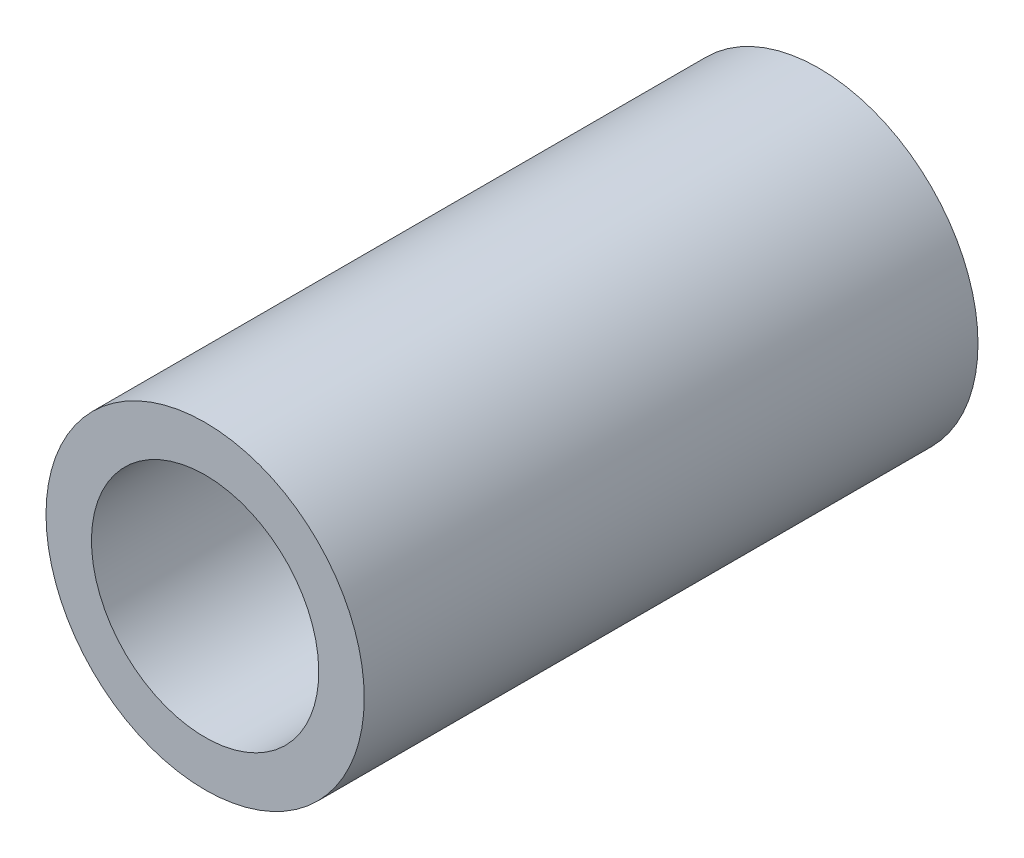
ISO-10303-21;
HEADER;
FILE_DESCRIPTION(('STEP AP214'),'2;1');
FILE_NAME('part.step','',(''),(''),'','','');
FILE_SCHEMA(('AUTOMOTIVE_DESIGN { 1 0 10303 214 1 1 1 1 }'));
ENDSEC;
DATA;
#1=APPLICATION_CONTEXT('core data for automotive mechanical design processes');
#2=APPLICATION_PROTOCOL_DEFINITION('international standard','automotive_design',2000,#1);
#3=PRODUCT_CONTEXT('',#1,'mechanical');
#4=PRODUCT('Part','Part','',(#3));
#5=PRODUCT_RELATED_PRODUCT_CATEGORY('part','',(#4));
#6=PRODUCT_DEFINITION_FORMATION('','',#4);
#7=PRODUCT_DEFINITION_CONTEXT('part definition',#1,'design');
#8=PRODUCT_DEFINITION('design','',#6,#7);
#9=PRODUCT_DEFINITION_SHAPE('','',#8);
#10=(LENGTH_UNIT() NAMED_UNIT(*) SI_UNIT(.MILLI.,.METRE.));
#11=(NAMED_UNIT(*) PLANE_ANGLE_UNIT() SI_UNIT($,.RADIAN.));
#12=(NAMED_UNIT(*) SI_UNIT($,.STERADIAN.) SOLID_ANGLE_UNIT());
#13=UNCERTAINTY_MEASURE_WITH_UNIT(LENGTH_MEASURE(1.E-05),#10,'distance_accuracy_value','');
#14=(GEOMETRIC_REPRESENTATION_CONTEXT(3) GLOBAL_UNCERTAINTY_ASSIGNED_CONTEXT((#13)) GLOBAL_UNIT_ASSIGNED_CONTEXT((#10,
#11,#12)) REPRESENTATION_CONTEXT('',''));
#15=CARTESIAN_POINT('',(0.,0.,0.));
#16=DIRECTION('',(0.,0.,1.));
#17=DIRECTION('',(1.,0.,0.));
#18=AXIS2_PLACEMENT_3D('',#15,#16,#17);
#19=CARTESIAN_POINT('',(0.,0.,27.));
#20=DIRECTION('',(0.,0.,-1.));
#21=DIRECTION('',(0.,1.,0.));
#22=AXIS2_PLACEMENT_3D('',#19,#20,#21);
#23=CYLINDRICAL_SURFACE('',#22,5.);
#24=CARTESIAN_POINT('',(0.,0.,0.));
#25=DIRECTION('',(0.,0.,-1.));
#26=DIRECTION('',(0.,1.,0.));
#27=AXIS2_PLACEMENT_3D('',#24,#25,#26);
#28=CIRCLE('',#27,5.);
#29=CARTESIAN_POINT('',(0.,5.,0.));
#30=VERTEX_POINT('',#29);
#31=EDGE_CURVE('E25',#30,#30,#28,.F.);
#32=ORIENTED_EDGE('',*,*,#31,.F.);
#33=EDGE_LOOP('',(#32));
#34=FACE_BOUND('',#33,.T.);
#35=CARTESIAN_POINT('',(0.,0.,27.));
#36=DIRECTION('',(0.,0.,-1.));
#37=DIRECTION('',(0.,1.,0.));
#38=AXIS2_PLACEMENT_3D('',#35,#36,#37);
#39=CIRCLE('',#38,5.);
#40=CARTESIAN_POINT('',(0.,5.,27.));
#41=VERTEX_POINT('',#40);
#42=EDGE_CURVE('E16',#41,#41,#39,.T.);
#43=ORIENTED_EDGE('',*,*,#42,.F.);
#44=EDGE_LOOP('',(#43));
#45=FACE_BOUND('',#44,.T.);
#46=ADVANCED_FACE('F12',(#34,#45),#23,.F.);
#47=CARTESIAN_POINT('',(5.,0.,27.));
#48=DIRECTION('',(0.,0.,-1.));
#49=DIRECTION('',(0.,1.,0.));
#50=AXIS2_PLACEMENT_3D('',#47,#48,#49);
#51=PLANE('',#50);
#52=ORIENTED_EDGE('',*,*,#42,.T.);
#53=EDGE_LOOP('',(#52));
#54=FACE_BOUND('',#53,.T.);
#55=CARTESIAN_POINT('',(0.,0.,27.));
#56=DIRECTION('',(0.,0.,-1.));
#57=DIRECTION('',(1.,0.,0.));
#58=AXIS2_PLACEMENT_3D('',#55,#56,#57);
#59=CIRCLE('',#58,7.);
#60=CARTESIAN_POINT('',(7.,0.,27.));
#61=VERTEX_POINT('',#60);
#62=EDGE_CURVE('E20',#61,#61,#59,.T.);
#63=ORIENTED_EDGE('',*,*,#62,.F.);
#64=EDGE_LOOP('',(#63));
#65=FACE_BOUND('',#64,.T.);
#66=ADVANCED_FACE('F33',(#54,#65),#51,.F.);
#67=CARTESIAN_POINT('',(5.,0.,0.));
#68=DIRECTION('',(0.,0.,1.));
#69=DIRECTION('',(0.,-1.,0.));
#70=AXIS2_PLACEMENT_3D('',#67,#68,#69);
#71=PLANE('',#70);
#72=ORIENTED_EDGE('',*,*,#31,.T.);
#73=EDGE_LOOP('',(#72));
#74=FACE_BOUND('',#73,.T.);
#75=CARTESIAN_POINT('',(0.,0.,0.));
#76=DIRECTION('',(0.,0.,-1.));
#77=DIRECTION('',(1.,0.,0.));
#78=AXIS2_PLACEMENT_3D('',#75,#76,#77);
#79=CIRCLE('',#78,7.);
#80=CARTESIAN_POINT('',(7.,0.,0.));
#81=VERTEX_POINT('',#80);
#82=EDGE_CURVE('E8',#81,#81,#79,.F.);
#83=ORIENTED_EDGE('',*,*,#82,.F.);
#84=EDGE_LOOP('',(#83));
#85=FACE_BOUND('',#84,.T.);
#86=ADVANCED_FACE('F44',(#74,#85),#71,.F.);
#87=CARTESIAN_POINT('',(0.,0.,0.));
#88=DIRECTION('',(0.,0.,-1.));
#89=DIRECTION('',(1.,0.,0.));
#90=AXIS2_PLACEMENT_3D('',#87,#88,#89);
#91=CYLINDRICAL_SURFACE('',#90,7.);
#92=ORIENTED_EDGE('',*,*,#82,.T.);
#93=EDGE_LOOP('',(#92));
#94=FACE_BOUND('',#93,.T.);
#95=ORIENTED_EDGE('',*,*,#62,.T.);
#96=EDGE_LOOP('',(#95));
#97=FACE_BOUND('',#96,.T.);
#98=ADVANCED_FACE('F14',(#94,#97),#91,.T.);
#99=CLOSED_SHELL('',(#46,#66,#86,#98));
#100=MANIFOLD_SOLID_BREP('B1',#99);
#101=ADVANCED_BREP_SHAPE_REPRESENTATION('',(#18,#100),#14);
#102=SHAPE_DEFINITION_REPRESENTATION(#9,#101);
ENDSEC;
END-ISO-10303-21;
